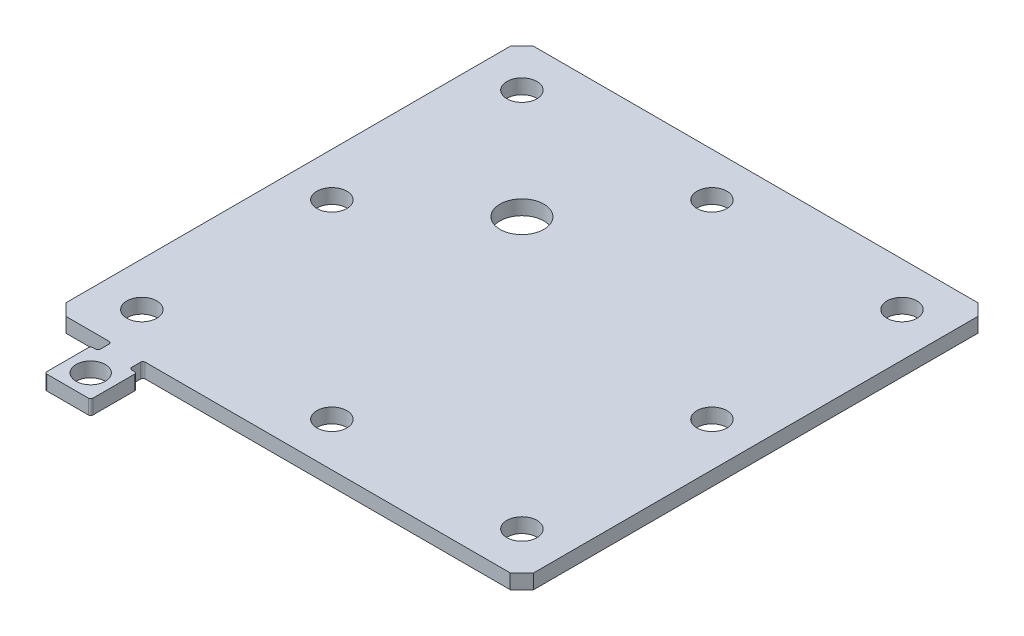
from build123d import *

# Parameters (mm, degrees)
SKETCH1_R           = 3.2639
SKETCH1_R_2         = 4.7625
SKETCH1_R_3         = 3.175
BOSS_EXTRUDE1_DEPTH = 3.175


with BuildPart() as part:
    # Sketch1 → Boss-Extrude1 (new body)
    with BuildSketch(Plane(origin=(0, 0, 0), x_dir=(1, 0, 0), z_dir=(0, 1, 0))):
        with BuildLine():
            Line((45.512230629, -44.650869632), (45.512230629, -53.650869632))
            ThreePointArc((45.512230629, -53.650869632), (45.658677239, -54.004423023), (46.012230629, -54.150869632))
            Line((46.012230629, -54.150869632), (55.012230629, -54.150869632))
            ThreePointArc((55.012230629, -54.150869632), (55.36578402, -54.004423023), (55.512230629, -53.650869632))
            Line((55.512230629, -53.650869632), (55.512230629, -44.650869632))
            ThreePointArc((55.512230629, -44.650869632), (55.36578402, -44.297316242), (55.012230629, -44.150869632))
            Line((55.012230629, -44.150869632), (54.424730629, -44.150869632))
            ThreePointArc((54.424730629, -44.150869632), (54.071177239, -44.004423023), (53.924730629, -43.650869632))
            Line((53.924730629, -43.650869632), (53.924730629, -41.712836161))
            ThreePointArc((53.924730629, -41.712836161), (54.071177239, -41.359282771), (54.424730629, -41.212836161))
            Line((54.424730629, -41.212836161), (133.697230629, -41.212836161))
            Line((133.697230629, -41.212836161), (136.237230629, -38.672836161))
            Line((136.237230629, -38.672836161), (136.237230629, 57.847163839))
            Line((136.237230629, 57.847163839), (133.697230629, 60.387163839))
            Line((133.697230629, 60.387163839), (37.177230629, 60.387163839))
            Line((37.177230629, 60.387163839), (34.637230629, 57.847163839))
            Line((34.637230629, 57.847163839), (34.637230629, -38.672836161))
            Line((34.637230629, -38.672836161), (37.177230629, -41.212836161))
            Line((37.177230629, -41.212836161), (46.599730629, -41.212836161))
            ThreePointArc((46.599730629, -41.212836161), (46.95328402, -41.359282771), (47.099730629, -41.712836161))
            Line((47.099730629, -41.712836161), (47.099730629, -43.650869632))
            ThreePointArc((47.099730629, -43.650869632), (46.95328402, -44.004423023), (46.599730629, -44.150869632))
            Line((46.599730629, -44.150869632), (46.012230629, -44.150869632))
            ThreePointArc((46.012230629, -44.150869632), (45.658677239, -44.297316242), (45.512230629, -44.650869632))
        make_face()
        with Locations(Location((44.162230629, 9.587163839, 0), (0, 0, 270))):
            Circle(SKETCH1_R, mode=Mode.SUBTRACT)
        with Locations(Location((44.162230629, -31.687836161, 0), (0, 0, 270))):
            Circle(SKETCH1_R, mode=Mode.SUBTRACT)
        with Locations(Location((85.437230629, -31.687836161, 0), (0, 0, 270))):
            Circle(SKETCH1_R, mode=Mode.SUBTRACT)
        with Locations(Location((126.712230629, -31.687836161, 0), (0, 0, 270))):
            Circle(SKETCH1_R, mode=Mode.SUBTRACT)
        with Locations(Location((126.712230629, 9.587163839, 0), (0, 0, 270))):
            Circle(SKETCH1_R, mode=Mode.SUBTRACT)
        with Locations(Location((126.712230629, 50.862163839, 0), (0, 0, 270))):
            Circle(SKETCH1_R, mode=Mode.SUBTRACT)
        with Locations(Location((85.437230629, 50.862163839, 0), (0, 0, 270))):
            Circle(SKETCH1_R, mode=Mode.SUBTRACT)
        with Locations(Location((44.162230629, 50.862163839, 0), (0, 0, 270))):
            Circle(SKETCH1_R, mode=Mode.SUBTRACT)
        with Locations(Location((67.974730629, 27.049663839, 0), (0, 0, 270))):
            Circle(SKETCH1_R_2, mode=Mode.SUBTRACT)
        with Locations(Location((50.512230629, -49.150869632, 0), (0, 0, 270))):
            Circle(SKETCH1_R_3, mode=Mode.SUBTRACT)
    extrude(amount=BOSS_EXTRUDE1_DEPTH)


solid = part.part
